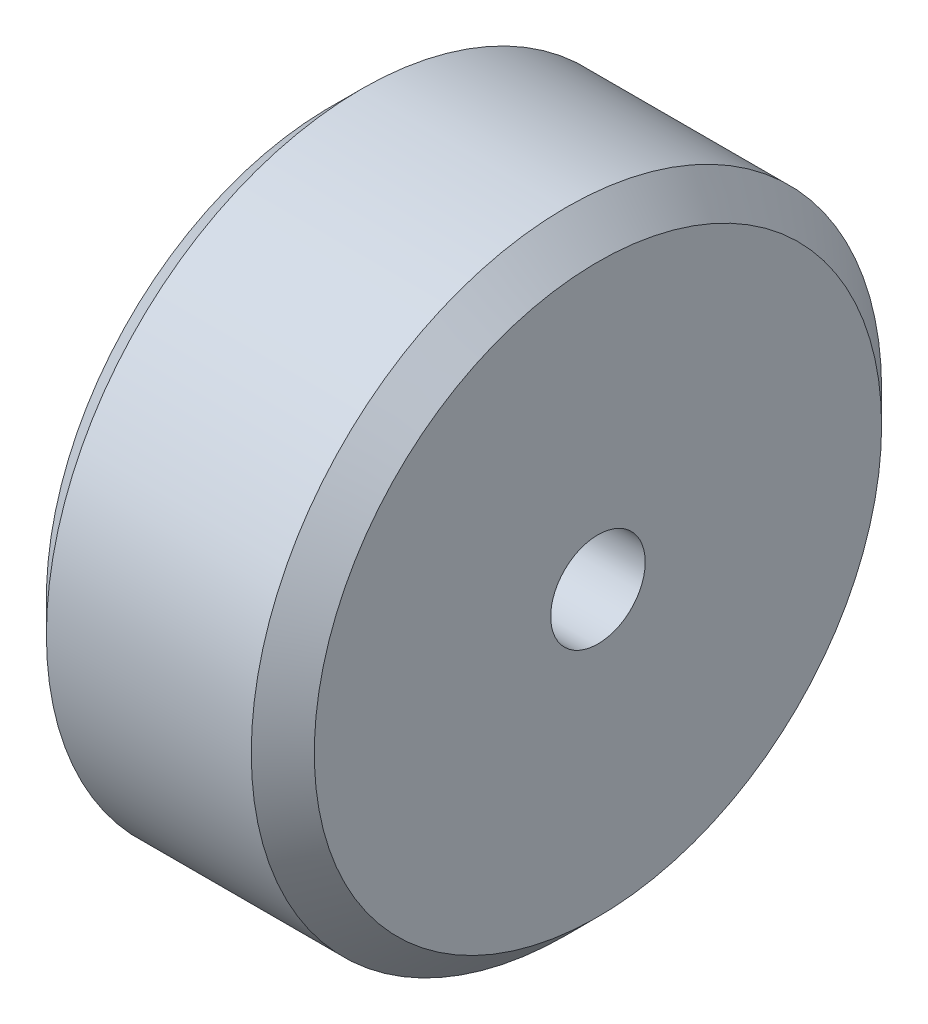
from build123d import *

# Parameters (mm, degrees)
SKETCH1_R           = 12.7
BOSS_EXTRUDE1_DEPTH = 10.795
SKETCH2_R           = 1.905
CUT_EXTRUDE1_DEPTH  = 10.795
CHAMFER1_SIZE       = 1.27


with BuildPart() as part:
    # Sketch1 → Boss-Extrude1 (new body)
    with BuildSketch(Plane(origin=(0, 0, 0), x_dir=(0, 0, -1), z_dir=(1, 0, 0))):
        Circle(SKETCH1_R)
    extrude(amount=BOSS_EXTRUDE1_DEPTH)

    # Sketch2 → Cut-Extrude1 (cut)
    with BuildSketch(Plane(origin=(10.795, 0, 0), x_dir=(0, 0, -1), z_dir=(1, 0, 0))):
        Circle(SKETCH2_R)
    extrude(amount=-CUT_EXTRUDE1_DEPTH, mode=Mode.SUBTRACT)

    # Chamfer1
    chamfer1_edges = [part.edges().sort_by_distance(p)[0] for p in [
        (0, 0, 12.7),
        (10.795, 0, 12.7),
    ]]
    chamfer(chamfer1_edges, length=CHAMFER1_SIZE)


solid = part.part
